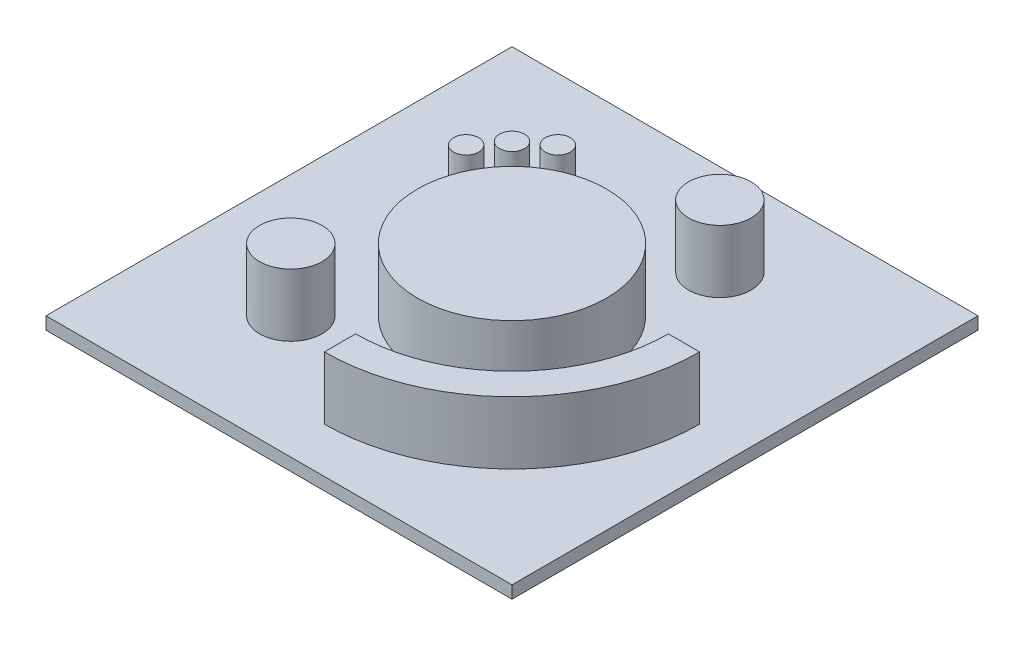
ISO-10303-21;
HEADER;
FILE_DESCRIPTION(('STEP AP214'),'2;1');
FILE_NAME('part.step','',(''),(''),'','','');
FILE_SCHEMA(('AUTOMOTIVE_DESIGN { 1 0 10303 214 1 1 1 1 }'));
ENDSEC;
DATA;
#1=APPLICATION_CONTEXT('core data for automotive mechanical design processes');
#2=APPLICATION_PROTOCOL_DEFINITION('international standard','automotive_design',2000,#1);
#3=PRODUCT_CONTEXT('',#1,'mechanical');
#4=PRODUCT('Part','Part','',(#3));
#5=PRODUCT_RELATED_PRODUCT_CATEGORY('part','',(#4));
#6=PRODUCT_DEFINITION_FORMATION('','',#4);
#7=PRODUCT_DEFINITION_CONTEXT('part definition',#1,'design');
#8=PRODUCT_DEFINITION('design','',#6,#7);
#9=PRODUCT_DEFINITION_SHAPE('','',#8);
#10=(LENGTH_UNIT() NAMED_UNIT(*) SI_UNIT(.MILLI.,.METRE.));
#11=(NAMED_UNIT(*) PLANE_ANGLE_UNIT() SI_UNIT($,.RADIAN.));
#12=(NAMED_UNIT(*) SI_UNIT($,.STERADIAN.) SOLID_ANGLE_UNIT());
#13=UNCERTAINTY_MEASURE_WITH_UNIT(LENGTH_MEASURE(1.E-05),#10,'distance_accuracy_value','');
#14=(GEOMETRIC_REPRESENTATION_CONTEXT(3) GLOBAL_UNCERTAINTY_ASSIGNED_CONTEXT((#13)) GLOBAL_UNIT_ASSIGNED_CONTEXT((#10,
#11,#12)) REPRESENTATION_CONTEXT('',''));
#15=CARTESIAN_POINT('',(0.,0.,0.));
#16=DIRECTION('',(0.,0.,1.));
#17=DIRECTION('',(1.,0.,0.));
#18=AXIS2_PLACEMENT_3D('',#15,#16,#17);
#19=CARTESIAN_POINT('',(-47.2962725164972,2.54,-47.2962725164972));
#20=DIRECTION('',(0.,-1.,0.));
#21=DIRECTION('',(0.,0.,-1.));
#22=AXIS2_PLACEMENT_3D('',#19,#20,#21);
#23=PLANE('',#22);
#24=CARTESIAN_POINT('',(13.4181298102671,2.54,-28.7752722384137));
#25=DIRECTION('',(0.,-1.,0.));
#26=DIRECTION('',(0.,0.,-1.));
#27=AXIS2_PLACEMENT_3D('',#24,#25,#26);
#28=CIRCLE('',#27,6.35);
#29=CARTESIAN_POINT('',(13.4181298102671,2.54,-35.1252722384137));
#30=VERTEX_POINT('',#29);
#31=EDGE_CURVE('E35',#30,#30,#28,.F.);
#32=ORIENTED_EDGE('',*,*,#31,.F.);
#33=EDGE_LOOP('',(#32));
#34=FACE_BOUND('',#33,.T.);
#35=CARTESIAN_POINT('',(-17.9605122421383,2.54,-17.9605122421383));
#36=DIRECTION('',(0.,-1.,0.));
#37=DIRECTION('',(0.,0.,-1.));
#38=AXIS2_PLACEMENT_3D('',#35,#36,#37);
#39=CIRCLE('',#38,2.54);
#40=CARTESIAN_POINT('',(-17.9605122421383,2.54,-20.5005122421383));
#41=VERTEX_POINT('',#40);
#42=EDGE_CURVE('E158',#41,#41,#39,.F.);
#43=ORIENTED_EDGE('',*,*,#42,.F.);
#44=EDGE_LOOP('',(#43));
#45=FACE_BOUND('',#44,.T.);
#46=CARTESIAN_POINT('',(0.,2.54,0.));
#47=DIRECTION('',(0.,-1.,0.));
#48=DIRECTION('',(0.,0.,-1.));
#49=AXIS2_PLACEMENT_3D('',#46,#47,#48);
#50=CIRCLE('',#49,19.1850048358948);
#51=CARTESIAN_POINT('',(0.,2.54,-19.1850048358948));
#52=VERTEX_POINT('',#51);
#53=EDGE_CURVE('E152',#52,#52,#50,.F.);
#54=ORIENTED_EDGE('',*,*,#53,.F.);
#55=EDGE_LOOP('',(#54));
#56=FACE_BOUND('',#55,.T.);
#57=DIRECTION('',(0.,0.,1.));
#58=VECTOR('',#57,1.);
#59=CARTESIAN_POINT('',(-47.2962725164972,2.54,47.2962725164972));
#60=LINE('',#59,#58);
#61=CARTESIAN_POINT('',(-47.2962725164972,2.54,-47.2962725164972));
#62=VERTEX_POINT('',#61);
#63=CARTESIAN_POINT('',(-47.2962725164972,2.54,47.2962725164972));
#64=VERTEX_POINT('',#63);
#65=EDGE_CURVE('E131',#62,#64,#60,.T.);
#66=ORIENTED_EDGE('',*,*,#65,.T.);
#67=DIRECTION('',(1.,0.,0.));
#68=VECTOR('',#67,1.);
#69=CARTESIAN_POINT('',(-47.2962725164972,2.54,47.2962725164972));
#70=LINE('',#69,#68);
#71=CARTESIAN_POINT('',(47.2962725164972,2.54,47.2962725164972));
#72=VERTEX_POINT('',#71);
#73=EDGE_CURVE('E134',#64,#72,#70,.T.);
#74=ORIENTED_EDGE('',*,*,#73,.T.);
#75=DIRECTION('',(0.,0.,-1.));
#76=VECTOR('',#75,1.);
#77=CARTESIAN_POINT('',(47.2962725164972,2.54,47.2962725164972));
#78=LINE('',#77,#76);
#79=CARTESIAN_POINT('',(47.2962725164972,2.54,-47.2962725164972));
#80=VERTEX_POINT('',#79);
#81=EDGE_CURVE('E136',#72,#80,#78,.T.);
#82=ORIENTED_EDGE('',*,*,#81,.T.);
#83=DIRECTION('',(-1.,0.,0.));
#84=VECTOR('',#83,1.);
#85=CARTESIAN_POINT('',(-47.2962725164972,2.54,-47.2962725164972));
#86=LINE('',#85,#84);
#87=EDGE_CURVE('E138',#80,#62,#86,.T.);
#88=ORIENTED_EDGE('',*,*,#87,.T.);
#89=EDGE_LOOP('',(#66,#74,#82,#88));
#90=FACE_BOUND('',#89,.T.);
#91=CARTESIAN_POINT('',(0.,2.54,0.));
#92=DIRECTION('',(0.,1.,0.));
#93=DIRECTION('',(0.,0.,1.));
#94=AXIS2_PLACEMENT_3D('',#91,#92,#93);
#95=CIRCLE('',#94,38.1);
#96=CARTESIAN_POINT('',(0.,2.54,38.1));
#97=VERTEX_POINT('',#96);
#98=CARTESIAN_POINT('',(38.1,2.54,0.));
#99=VERTEX_POINT('',#98);
#100=EDGE_CURVE('E88',#97,#99,#95,.T.);
#101=ORIENTED_EDGE('',*,*,#100,.F.);
#102=DIRECTION('',(0.,0.,1.));
#103=VECTOR('',#102,1.);
#104=CARTESIAN_POINT('',(0.,2.54,31.75));
#105=LINE('',#104,#103);
#106=CARTESIAN_POINT('',(0.,2.54,31.75));
#107=VERTEX_POINT('',#106);
#108=EDGE_CURVE('E91',#107,#97,#105,.T.);
#109=ORIENTED_EDGE('',*,*,#108,.F.);
#110=CARTESIAN_POINT('',(0.,2.54,0.));
#111=DIRECTION('',(0.,-1.,0.));
#112=DIRECTION('',(0.,0.,-1.));
#113=AXIS2_PLACEMENT_3D('',#110,#111,#112);
#114=CIRCLE('',#113,31.75);
#115=CARTESIAN_POINT('',(31.75,2.54,0.));
#116=VERTEX_POINT('',#115);
#117=EDGE_CURVE('E47',#116,#107,#114,.T.);
#118=ORIENTED_EDGE('',*,*,#117,.F.);
#119=DIRECTION('',(-1.,0.,0.));
#120=VECTOR('',#119,1.);
#121=CARTESIAN_POINT('',(31.75,2.54,0.));
#122=LINE('',#121,#120);
#123=EDGE_CURVE('E42',#99,#116,#122,.T.);
#124=ORIENTED_EDGE('',*,*,#123,.F.);
#125=EDGE_LOOP('',(#101,#109,#118,#124));
#126=FACE_BOUND('',#125,.T.);
#127=CARTESIAN_POINT('',(-12.6999999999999,2.54,-21.9970452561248));
#128=DIRECTION('',(0.,-1.,0.));
#129=DIRECTION('',(0.,0.,-1.));
#130=AXIS2_PLACEMENT_3D('',#127,#128,#129);
#131=CIRCLE('',#130,2.54);
#132=CARTESIAN_POINT('',(-12.6999999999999,2.54,-24.5370452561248));
#133=VERTEX_POINT('',#132);
#134=EDGE_CURVE('E155',#133,#133,#131,.F.);
#135=ORIENTED_EDGE('',*,*,#134,.F.);
#136=EDGE_LOOP('',(#135));
#137=FACE_BOUND('',#136,.T.);
#138=CARTESIAN_POINT('',(-21.9970452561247,2.54,-12.7));
#139=DIRECTION('',(0.,-1.,0.));
#140=DIRECTION('',(0.,0.,-1.));
#141=AXIS2_PLACEMENT_3D('',#138,#139,#140);
#142=CIRCLE('',#141,2.54);
#143=CARTESIAN_POINT('',(-21.9970452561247,2.54,-15.24));
#144=VERTEX_POINT('',#143);
#145=EDGE_CURVE('E161',#144,#144,#142,.F.);
#146=ORIENTED_EDGE('',*,*,#145,.F.);
#147=EDGE_LOOP('',(#146));
#148=FACE_BOUND('',#147,.T.);
#149=CARTESIAN_POINT('',(-22.4506403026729,2.54,22.4506403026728));
#150=DIRECTION('',(0.,-1.,0.));
#151=DIRECTION('',(0.,0.,-1.));
#152=AXIS2_PLACEMENT_3D('',#149,#150,#151);
#153=CIRCLE('',#152,6.35);
#154=CARTESIAN_POINT('',(-22.4506403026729,2.54,16.1006403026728));
#155=VERTEX_POINT('',#154);
#156=EDGE_CURVE('E11',#155,#155,#153,.F.);
#157=ORIENTED_EDGE('',*,*,#156,.F.);
#158=EDGE_LOOP('',(#157));
#159=FACE_BOUND('',#158,.T.);
#160=ADVANCED_FACE('F27',(#34,#45,#56,#90,#126,#137,#148,#159),#23,.F.);
#161=CARTESIAN_POINT('',(-47.2962725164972,2.54,47.2962725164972));
#162=DIRECTION('',(1.,0.,0.));
#163=DIRECTION('',(0.,0.,-1.));
#164=AXIS2_PLACEMENT_3D('',#161,#162,#163);
#165=PLANE('',#164);
#166=DIRECTION('',(0.,0.,1.));
#167=VECTOR('',#166,1.);
#168=CARTESIAN_POINT('',(-47.2962725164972,0.,47.2962725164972));
#169=LINE('',#168,#167);
#170=CARTESIAN_POINT('',(-47.2962725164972,0.,-47.2962725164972));
#171=VERTEX_POINT('',#170);
#172=CARTESIAN_POINT('',(-47.2962725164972,0.,47.2962725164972));
#173=VERTEX_POINT('',#172);
#174=EDGE_CURVE('E122',#171,#173,#169,.T.);
#175=ORIENTED_EDGE('',*,*,#174,.T.);
#176=DIRECTION('',(0.,-1.,0.));
#177=VECTOR('',#176,1.);
#178=CARTESIAN_POINT('',(-47.2962725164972,2.54,47.2962725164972));
#179=LINE('',#178,#177);
#180=EDGE_CURVE('E149',#64,#173,#179,.T.);
#181=ORIENTED_EDGE('',*,*,#180,.F.);
#182=ORIENTED_EDGE('',*,*,#65,.F.);
#183=DIRECTION('',(0.,-1.,0.));
#184=VECTOR('',#183,1.);
#185=CARTESIAN_POINT('',(-47.2962725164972,2.54,-47.2962725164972));
#186=LINE('',#185,#184);
#187=EDGE_CURVE('E140',#62,#171,#186,.T.);
#188=ORIENTED_EDGE('',*,*,#187,.T.);
#189=EDGE_LOOP('',(#175,#181,#182,#188));
#190=FACE_BOUND('',#189,.T.);
#191=ADVANCED_FACE('F29',(#190),#165,.F.);
#192=CARTESIAN_POINT('',(-47.2962725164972,2.54,47.2962725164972));
#193=DIRECTION('',(0.,0.,-1.));
#194=DIRECTION('',(-1.,0.,0.));
#195=AXIS2_PLACEMENT_3D('',#192,#193,#194);
#196=PLANE('',#195);
#197=DIRECTION('',(1.,0.,0.));
#198=VECTOR('',#197,1.);
#199=CARTESIAN_POINT('',(-47.2962725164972,0.,47.2962725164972));
#200=LINE('',#199,#198);
#201=CARTESIAN_POINT('',(47.2962725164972,0.,47.2962725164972));
#202=VERTEX_POINT('',#201);
#203=EDGE_CURVE('E125',#173,#202,#200,.T.);
#204=ORIENTED_EDGE('',*,*,#203,.T.);
#205=DIRECTION('',(0.,-1.,0.));
#206=VECTOR('',#205,1.);
#207=CARTESIAN_POINT('',(47.2962725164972,2.54,47.2962725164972));
#208=LINE('',#207,#206);
#209=EDGE_CURVE('E146',#72,#202,#208,.T.);
#210=ORIENTED_EDGE('',*,*,#209,.F.);
#211=ORIENTED_EDGE('',*,*,#73,.F.);
#212=ORIENTED_EDGE('',*,*,#180,.T.);
#213=EDGE_LOOP('',(#204,#210,#211,#212));
#214=FACE_BOUND('',#213,.T.);
#215=ADVANCED_FACE('F183',(#214),#196,.F.);
#216=CARTESIAN_POINT('',(47.2962725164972,2.54,47.2962725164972));
#217=DIRECTION('',(-1.,0.,0.));
#218=DIRECTION('',(0.,0.,1.));
#219=AXIS2_PLACEMENT_3D('',#216,#217,#218);
#220=PLANE('',#219);
#221=DIRECTION('',(0.,0.,-1.));
#222=VECTOR('',#221,1.);
#223=CARTESIAN_POINT('',(47.2962725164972,0.,47.2962725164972));
#224=LINE('',#223,#222);
#225=CARTESIAN_POINT('',(47.2962725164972,0.,-47.2962725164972));
#226=VERTEX_POINT('',#225);
#227=EDGE_CURVE('E127',#202,#226,#224,.T.);
#228=ORIENTED_EDGE('',*,*,#227,.T.);
#229=DIRECTION('',(0.,-1.,0.));
#230=VECTOR('',#229,1.);
#231=CARTESIAN_POINT('',(47.2962725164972,2.54,-47.2962725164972));
#232=LINE('',#231,#230);
#233=EDGE_CURVE('E143',#80,#226,#232,.T.);
#234=ORIENTED_EDGE('',*,*,#233,.F.);
#235=ORIENTED_EDGE('',*,*,#81,.F.);
#236=ORIENTED_EDGE('',*,*,#209,.T.);
#237=EDGE_LOOP('',(#228,#234,#235,#236));
#238=FACE_BOUND('',#237,.T.);
#239=ADVANCED_FACE('F188',(#238),#220,.F.);
#240=CARTESIAN_POINT('',(-47.2962725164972,2.54,-47.2962725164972));
#241=DIRECTION('',(0.,0.,1.));
#242=DIRECTION('',(1.,0.,0.));
#243=AXIS2_PLACEMENT_3D('',#240,#241,#242);
#244=PLANE('',#243);
#245=DIRECTION('',(-1.,0.,0.));
#246=VECTOR('',#245,1.);
#247=CARTESIAN_POINT('',(-47.2962725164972,0.,-47.2962725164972));
#248=LINE('',#247,#246);
#249=EDGE_CURVE('E129',#226,#171,#248,.T.);
#250=ORIENTED_EDGE('',*,*,#249,.T.);
#251=ORIENTED_EDGE('',*,*,#187,.F.);
#252=ORIENTED_EDGE('',*,*,#87,.F.);
#253=ORIENTED_EDGE('',*,*,#233,.T.);
#254=EDGE_LOOP('',(#250,#251,#252,#253));
#255=FACE_BOUND('',#254,.T.);
#256=ADVANCED_FACE('F191',(#255),#244,.F.);
#257=CARTESIAN_POINT('',(-47.2962725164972,0.,-47.2962725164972));
#258=DIRECTION('',(0.,-1.,0.));
#259=DIRECTION('',(0.,0.,-1.));
#260=AXIS2_PLACEMENT_3D('',#257,#258,#259);
#261=PLANE('',#260);
#262=ORIENTED_EDGE('',*,*,#174,.F.);
#263=ORIENTED_EDGE('',*,*,#249,.F.);
#264=ORIENTED_EDGE('',*,*,#227,.F.);
#265=ORIENTED_EDGE('',*,*,#203,.F.);
#266=EDGE_LOOP('',(#262,#263,#264,#265));
#267=FACE_BOUND('',#266,.T.);
#268=ADVANCED_FACE('F193',(#267),#261,.T.);
#269=CARTESIAN_POINT('',(0.,15.24,0.));
#270=DIRECTION('',(0.,-1.,0.));
#271=DIRECTION('',(0.,0.,-1.));
#272=AXIS2_PLACEMENT_3D('',#269,#270,#271);
#273=CYLINDRICAL_SURFACE('',#272,38.1);
#274=ORIENTED_EDGE('',*,*,#100,.T.);
#275=DIRECTION('',(0.,-1.,0.));
#276=VECTOR('',#275,1.);
#277=CARTESIAN_POINT('',(38.1,15.24,0.));
#278=LINE('',#277,#276);
#279=CARTESIAN_POINT('',(38.1,15.24,0.));
#280=VERTEX_POINT('',#279);
#281=EDGE_CURVE('E120',#280,#99,#278,.T.);
#282=ORIENTED_EDGE('',*,*,#281,.F.);
#283=CARTESIAN_POINT('',(0.,15.24,0.));
#284=DIRECTION('',(0.,1.,0.));
#285=DIRECTION('',(0.,0.,1.));
#286=AXIS2_PLACEMENT_3D('',#283,#284,#285);
#287=CIRCLE('',#286,38.1);
#288=CARTESIAN_POINT('',(0.,15.24,38.1));
#289=VERTEX_POINT('',#288);
#290=EDGE_CURVE('E106',#289,#280,#287,.T.);
#291=ORIENTED_EDGE('',*,*,#290,.F.);
#292=DIRECTION('',(0.,-1.,0.));
#293=VECTOR('',#292,1.);
#294=CARTESIAN_POINT('',(0.,15.24,38.1));
#295=LINE('',#294,#293);
#296=EDGE_CURVE('E102',#289,#97,#295,.T.);
#297=ORIENTED_EDGE('',*,*,#296,.T.);
#298=EDGE_LOOP('',(#274,#282,#291,#297));
#299=FACE_BOUND('',#298,.T.);
#300=ADVANCED_FACE('F108',(#299),#273,.T.);
#301=CARTESIAN_POINT('',(31.75,15.24,0.));
#302=DIRECTION('',(0.,0.,1.));
#303=DIRECTION('',(1.,0.,0.));
#304=AXIS2_PLACEMENT_3D('',#301,#302,#303);
#305=PLANE('',#304);
#306=ORIENTED_EDGE('',*,*,#123,.T.);
#307=DIRECTION('',(0.,-1.,0.));
#308=VECTOR('',#307,1.);
#309=CARTESIAN_POINT('',(31.75,15.24,0.));
#310=LINE('',#309,#308);
#311=CARTESIAN_POINT('',(31.75,15.24,0.));
#312=VERTEX_POINT('',#311);
#313=EDGE_CURVE('E112',#312,#116,#310,.T.);
#314=ORIENTED_EDGE('',*,*,#313,.F.);
#315=DIRECTION('',(-1.,0.,0.));
#316=VECTOR('',#315,1.);
#317=CARTESIAN_POINT('',(31.75,15.24,0.));
#318=LINE('',#317,#316);
#319=EDGE_CURVE('E379',#280,#312,#318,.T.);
#320=ORIENTED_EDGE('',*,*,#319,.F.);
#321=ORIENTED_EDGE('',*,*,#281,.T.);
#322=EDGE_LOOP('',(#306,#314,#320,#321));
#323=FACE_BOUND('',#322,.T.);
#324=ADVANCED_FACE('F200',(#323),#305,.F.);
#325=CARTESIAN_POINT('',(0.,15.24,0.));
#326=DIRECTION('',(0.,-1.,0.));
#327=DIRECTION('',(0.,0.,-1.));
#328=AXIS2_PLACEMENT_3D('',#325,#326,#327);
#329=CYLINDRICAL_SURFACE('',#328,31.75);
#330=ORIENTED_EDGE('',*,*,#117,.T.);
#331=DIRECTION('',(0.,-1.,0.));
#332=VECTOR('',#331,1.);
#333=CARTESIAN_POINT('',(0.,15.24,31.75));
#334=LINE('',#333,#332);
#335=CARTESIAN_POINT('',(0.,15.24,31.75));
#336=VERTEX_POINT('',#335);
#337=EDGE_CURVE('E105',#336,#107,#334,.T.);
#338=ORIENTED_EDGE('',*,*,#337,.F.);
#339=CARTESIAN_POINT('',(0.,15.24,0.));
#340=DIRECTION('',(0.,-1.,0.));
#341=DIRECTION('',(0.,0.,-1.));
#342=AXIS2_PLACEMENT_3D('',#339,#340,#341);
#343=CIRCLE('',#342,31.75);
#344=EDGE_CURVE('E114',#312,#336,#343,.T.);
#345=ORIENTED_EDGE('',*,*,#344,.F.);
#346=ORIENTED_EDGE('',*,*,#313,.T.);
#347=EDGE_LOOP('',(#330,#338,#345,#346));
#348=FACE_BOUND('',#347,.T.);
#349=ADVANCED_FACE('F239',(#348),#329,.F.);
#350=CARTESIAN_POINT('',(0.,15.24,31.75));
#351=DIRECTION('',(1.,0.,0.));
#352=DIRECTION('',(0.,0.,-1.));
#353=AXIS2_PLACEMENT_3D('',#350,#351,#352);
#354=PLANE('',#353);
#355=ORIENTED_EDGE('',*,*,#108,.T.);
#356=ORIENTED_EDGE('',*,*,#296,.F.);
#357=DIRECTION('',(0.,0.,1.));
#358=VECTOR('',#357,1.);
#359=CARTESIAN_POINT('',(0.,15.24,31.75));
#360=LINE('',#359,#358);
#361=EDGE_CURVE('E110',#336,#289,#360,.T.);
#362=ORIENTED_EDGE('',*,*,#361,.F.);
#363=ORIENTED_EDGE('',*,*,#337,.T.);
#364=EDGE_LOOP('',(#355,#356,#362,#363));
#365=FACE_BOUND('',#364,.T.);
#366=ADVANCED_FACE('F100',(#365),#354,.F.);
#367=CARTESIAN_POINT('',(0.,15.24,0.));
#368=DIRECTION('',(0.,1.,0.));
#369=DIRECTION('',(0.,0.,1.));
#370=AXIS2_PLACEMENT_3D('',#367,#368,#369);
#371=PLANE('',#370);
#372=ORIENTED_EDGE('',*,*,#290,.T.);
#373=ORIENTED_EDGE('',*,*,#319,.T.);
#374=ORIENTED_EDGE('',*,*,#344,.T.);
#375=ORIENTED_EDGE('',*,*,#361,.T.);
#376=EDGE_LOOP('',(#372,#373,#374,#375));
#377=FACE_BOUND('',#376,.T.);
#378=ADVANCED_FACE('F253',(#377),#371,.T.);
#379=CARTESIAN_POINT('',(0.,15.24,0.));
#380=DIRECTION('',(0.,-1.,0.));
#381=DIRECTION('',(0.,0.,-1.));
#382=AXIS2_PLACEMENT_3D('',#379,#380,#381);
#383=CYLINDRICAL_SURFACE('',#382,19.1850048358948);
#384=CARTESIAN_POINT('',(0.,15.24,0.));
#385=DIRECTION('',(0.,1.,0.));
#386=DIRECTION('',(0.,0.,1.));
#387=AXIS2_PLACEMENT_3D('',#384,#385,#386);
#388=CIRCLE('',#387,19.1850048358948);
#389=CARTESIAN_POINT('',(0.,15.24,19.1850048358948));
#390=VERTEX_POINT('',#389);
#391=EDGE_CURVE('E95',#390,#390,#388,.T.);
#392=ORIENTED_EDGE('',*,*,#391,.F.);
#393=EDGE_LOOP('',(#392));
#394=FACE_BOUND('',#393,.T.);
#395=ORIENTED_EDGE('',*,*,#53,.T.);
#396=EDGE_LOOP('',(#395));
#397=FACE_BOUND('',#396,.T.);
#398=ADVANCED_FACE('F260',(#394,#397),#383,.T.);
#399=CARTESIAN_POINT('',(0.,15.24,0.));
#400=DIRECTION('',(0.,1.,0.));
#401=DIRECTION('',(0.,0.,1.));
#402=AXIS2_PLACEMENT_3D('',#399,#400,#401);
#403=PLANE('',#402);
#404=ORIENTED_EDGE('',*,*,#391,.T.);
#405=EDGE_LOOP('',(#404));
#406=FACE_BOUND('',#405,.T.);
#407=ADVANCED_FACE('F268',(#406),#403,.T.);
#408=CARTESIAN_POINT('',(-12.6999999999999,15.24,-21.9970452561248));
#409=DIRECTION('',(0.,-1.,0.));
#410=DIRECTION('',(0.,0.,-1.));
#411=AXIS2_PLACEMENT_3D('',#408,#409,#410);
#412=CYLINDRICAL_SURFACE('',#411,2.54);
#413=CARTESIAN_POINT('',(-12.6999999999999,15.24,-21.9970452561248));
#414=DIRECTION('',(0.,1.,0.));
#415=DIRECTION('',(0.,0.,1.));
#416=AXIS2_PLACEMENT_3D('',#413,#414,#415);
#417=CIRCLE('',#416,2.54);
#418=CARTESIAN_POINT('',(-12.6999999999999,15.24,-19.4570452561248));
#419=VERTEX_POINT('',#418);
#420=EDGE_CURVE('E371',#419,#419,#417,.T.);
#421=ORIENTED_EDGE('',*,*,#420,.F.);
#422=EDGE_LOOP('',(#421));
#423=FACE_BOUND('',#422,.T.);
#424=ORIENTED_EDGE('',*,*,#134,.T.);
#425=EDGE_LOOP('',(#424));
#426=FACE_BOUND('',#425,.T.);
#427=ADVANCED_FACE('F276',(#423,#426),#412,.T.);
#428=CARTESIAN_POINT('',(-12.6999999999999,15.24,-21.9970452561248));
#429=DIRECTION('',(0.,1.,0.));
#430=DIRECTION('',(0.,0.,1.));
#431=AXIS2_PLACEMENT_3D('',#428,#429,#430);
#432=PLANE('',#431);
#433=ORIENTED_EDGE('',*,*,#420,.T.);
#434=EDGE_LOOP('',(#433));
#435=FACE_BOUND('',#434,.T.);
#436=ADVANCED_FACE('F284',(#435),#432,.T.);
#437=CARTESIAN_POINT('',(-17.9605122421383,15.24,-17.9605122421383));
#438=DIRECTION('',(0.,-1.,0.));
#439=DIRECTION('',(0.,0.,-1.));
#440=AXIS2_PLACEMENT_3D('',#437,#438,#439);
#441=CYLINDRICAL_SURFACE('',#440,2.54);
#442=CARTESIAN_POINT('',(-17.9605122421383,15.24,-17.9605122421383));
#443=DIRECTION('',(0.,1.,0.));
#444=DIRECTION('',(0.,0.,1.));
#445=AXIS2_PLACEMENT_3D('',#442,#443,#444);
#446=CIRCLE('',#445,2.54);
#447=CARTESIAN_POINT('',(-17.9605122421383,15.24,-15.4205122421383));
#448=VERTEX_POINT('',#447);
#449=EDGE_CURVE('E368',#448,#448,#446,.T.);
#450=ORIENTED_EDGE('',*,*,#449,.F.);
#451=EDGE_LOOP('',(#450));
#452=FACE_BOUND('',#451,.T.);
#453=ORIENTED_EDGE('',*,*,#42,.T.);
#454=EDGE_LOOP('',(#453));
#455=FACE_BOUND('',#454,.T.);
#456=ADVANCED_FACE('F292',(#452,#455),#441,.T.);
#457=CARTESIAN_POINT('',(-17.9605122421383,15.24,-17.9605122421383));
#458=DIRECTION('',(0.,1.,0.));
#459=DIRECTION('',(0.,0.,1.));
#460=AXIS2_PLACEMENT_3D('',#457,#458,#459);
#461=PLANE('',#460);
#462=ORIENTED_EDGE('',*,*,#449,.T.);
#463=EDGE_LOOP('',(#462));
#464=FACE_BOUND('',#463,.T.);
#465=ADVANCED_FACE('F300',(#464),#461,.T.);
#466=CARTESIAN_POINT('',(-21.9970452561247,15.24,-12.7));
#467=DIRECTION('',(0.,-1.,0.));
#468=DIRECTION('',(0.,0.,-1.));
#469=AXIS2_PLACEMENT_3D('',#466,#467,#468);
#470=CYLINDRICAL_SURFACE('',#469,2.54);
#471=CARTESIAN_POINT('',(-21.9970452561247,15.24,-12.7));
#472=DIRECTION('',(0.,1.,0.));
#473=DIRECTION('',(0.,0.,1.));
#474=AXIS2_PLACEMENT_3D('',#471,#472,#473);
#475=CIRCLE('',#474,2.54);
#476=CARTESIAN_POINT('',(-21.9970452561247,15.24,-10.16));
#477=VERTEX_POINT('',#476);
#478=EDGE_CURVE('E363',#477,#477,#475,.T.);
#479=ORIENTED_EDGE('',*,*,#478,.F.);
#480=EDGE_LOOP('',(#479));
#481=FACE_BOUND('',#480,.T.);
#482=ORIENTED_EDGE('',*,*,#145,.T.);
#483=EDGE_LOOP('',(#482));
#484=FACE_BOUND('',#483,.T.);
#485=ADVANCED_FACE('F308',(#481,#484),#470,.T.);
#486=CARTESIAN_POINT('',(-21.9970452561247,15.24,-12.7));
#487=DIRECTION('',(0.,1.,0.));
#488=DIRECTION('',(0.,0.,1.));
#489=AXIS2_PLACEMENT_3D('',#486,#487,#488);
#490=PLANE('',#489);
#491=ORIENTED_EDGE('',*,*,#478,.T.);
#492=EDGE_LOOP('',(#491));
#493=FACE_BOUND('',#492,.T.);
#494=ADVANCED_FACE('F316',(#493),#490,.T.);
#495=CARTESIAN_POINT('',(13.4181298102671,15.24,-28.7752722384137));
#496=DIRECTION('',(0.,-1.,0.));
#497=DIRECTION('',(0.,0.,-1.));
#498=AXIS2_PLACEMENT_3D('',#495,#496,#497);
#499=CYLINDRICAL_SURFACE('',#498,6.35);
#500=CARTESIAN_POINT('',(13.4181298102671,15.24,-28.7752722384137));
#501=DIRECTION('',(0.,1.,0.));
#502=DIRECTION('',(0.,0.,1.));
#503=AXIS2_PLACEMENT_3D('',#500,#501,#502);
#504=CIRCLE('',#503,6.35);
#505=CARTESIAN_POINT('',(13.4181298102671,15.24,-22.4252722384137));
#506=VERTEX_POINT('',#505);
#507=EDGE_CURVE('E360',#506,#506,#504,.T.);
#508=ORIENTED_EDGE('',*,*,#507,.F.);
#509=EDGE_LOOP('',(#508));
#510=FACE_BOUND('',#509,.T.);
#511=ORIENTED_EDGE('',*,*,#31,.T.);
#512=EDGE_LOOP('',(#511));
#513=FACE_BOUND('',#512,.T.);
#514=ADVANCED_FACE('F166',(#510,#513),#499,.T.);
#515=CARTESIAN_POINT('',(13.4181298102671,15.24,-28.7752722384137));
#516=DIRECTION('',(0.,1.,0.));
#517=DIRECTION('',(0.,0.,1.));
#518=AXIS2_PLACEMENT_3D('',#515,#516,#517);
#519=PLANE('',#518);
#520=ORIENTED_EDGE('',*,*,#507,.T.);
#521=EDGE_LOOP('',(#520));
#522=FACE_BOUND('',#521,.T.);
#523=ADVANCED_FACE('F331',(#522),#519,.T.);
#524=CARTESIAN_POINT('',(-22.4506403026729,15.24,22.4506403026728));
#525=DIRECTION('',(0.,-1.,0.));
#526=DIRECTION('',(0.,0.,-1.));
#527=AXIS2_PLACEMENT_3D('',#524,#525,#526);
#528=CYLINDRICAL_SURFACE('',#527,6.35);
#529=CARTESIAN_POINT('',(-22.4506403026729,15.24,22.4506403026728));
#530=DIRECTION('',(0.,1.,0.));
#531=DIRECTION('',(0.,0.,1.));
#532=AXIS2_PLACEMENT_3D('',#529,#530,#531);
#533=CIRCLE('',#532,6.35);
#534=CARTESIAN_POINT('',(-22.4506403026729,15.24,28.8006403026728));
#535=VERTEX_POINT('',#534);
#536=EDGE_CURVE('E359',#535,#535,#533,.T.);
#537=ORIENTED_EDGE('',*,*,#536,.F.);
#538=EDGE_LOOP('',(#537));
#539=FACE_BOUND('',#538,.T.);
#540=ORIENTED_EDGE('',*,*,#156,.T.);
#541=EDGE_LOOP('',(#540));
#542=FACE_BOUND('',#541,.T.);
#543=ADVANCED_FACE('F339',(#539,#542),#528,.T.);
#544=CARTESIAN_POINT('',(-22.4506403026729,15.24,22.4506403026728));
#545=DIRECTION('',(0.,1.,0.));
#546=DIRECTION('',(0.,0.,1.));
#547=AXIS2_PLACEMENT_3D('',#544,#545,#546);
#548=PLANE('',#547);
#549=ORIENTED_EDGE('',*,*,#536,.T.);
#550=EDGE_LOOP('',(#549));
#551=FACE_BOUND('',#550,.T.);
#552=ADVANCED_FACE('F347',(#551),#548,.T.);
#553=CLOSED_SHELL('',(#160,#191,#215,#239,#256,#268,#300,#324,#349,#366,#378,#398,#407,#427,
#436,#456,#465,#485,#494,#514,#523,#543,#552));
#554=MANIFOLD_SOLID_BREP('B2',#553);
#555=ADVANCED_BREP_SHAPE_REPRESENTATION('',(#18,#554),#14);
#556=SHAPE_DEFINITION_REPRESENTATION(#9,#555);
ENDSEC;
END-ISO-10303-21;
